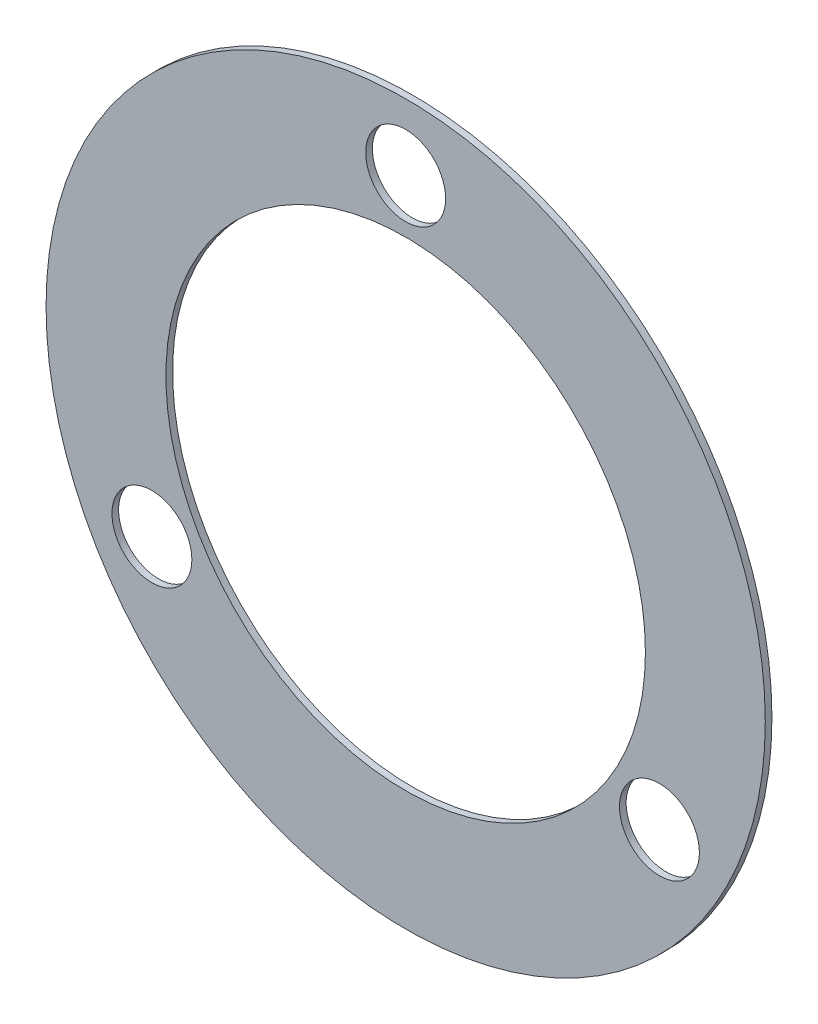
from build123d import *

# Parameters (mm, degrees)
ESQUISSE1_R          = 27
ESQUISSE1_R_2        = 3
ESQUISSE1_R_3        = 18
BASE_EXTRUSION_DEPTH = 0.5


with BuildPart() as part:
    # Esquisse1 → Base-Extrusion (new body)
    with BuildSketch(Plane.XY):
        Circle(ESQUISSE1_R)
        with Locations((19.052558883, -11)):
            Circle(ESQUISSE1_R_2, mode=Mode.SUBTRACT)
        with Locations((-19.052558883, -11)):
            Circle(ESQUISSE1_R_2, mode=Mode.SUBTRACT)
        with Locations((0, 22)):
            Circle(ESQUISSE1_R_2, mode=Mode.SUBTRACT)
        Circle(ESQUISSE1_R_3, mode=Mode.SUBTRACT)
    extrude(amount=BASE_EXTRUSION_DEPTH)


solid = part.part
